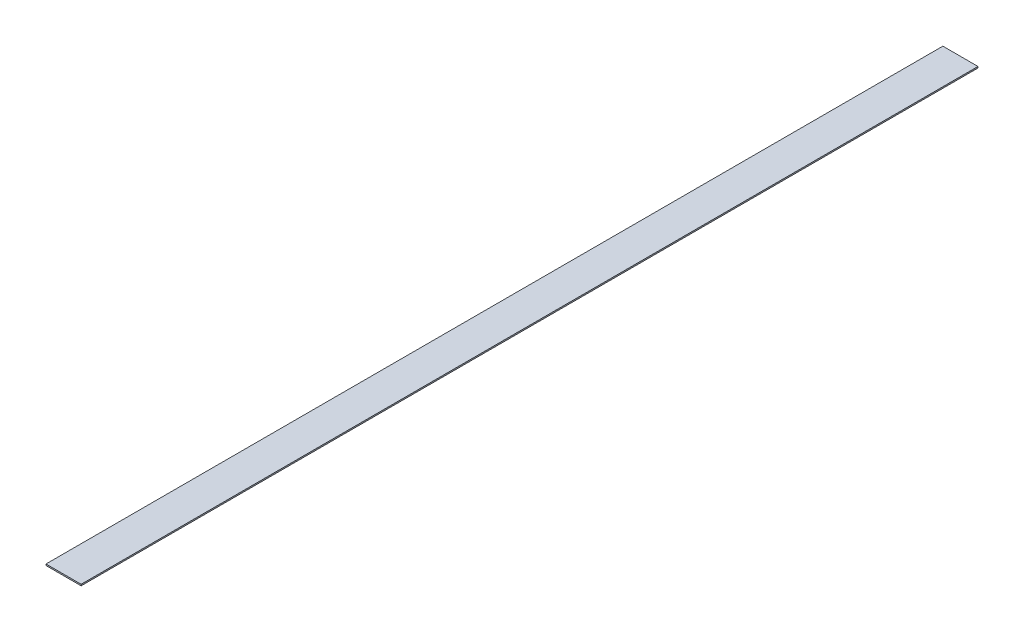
ISO-10303-21;
HEADER;
FILE_DESCRIPTION(('STEP AP214'),'2;1');
FILE_NAME('part.step','',(''),(''),'','','');
FILE_SCHEMA(('AUTOMOTIVE_DESIGN { 1 0 10303 214 1 1 1 1 }'));
ENDSEC;
DATA;
#1=APPLICATION_CONTEXT('core data for automotive mechanical design processes');
#2=APPLICATION_PROTOCOL_DEFINITION('international standard','automotive_design',2000,#1);
#3=PRODUCT_CONTEXT('',#1,'mechanical');
#4=PRODUCT('Part','Part','',(#3));
#5=PRODUCT_RELATED_PRODUCT_CATEGORY('part','',(#4));
#6=PRODUCT_DEFINITION_FORMATION('','',#4);
#7=PRODUCT_DEFINITION_CONTEXT('part definition',#1,'design');
#8=PRODUCT_DEFINITION('design','',#6,#7);
#9=PRODUCT_DEFINITION_SHAPE('','',#8);
#10=(LENGTH_UNIT() NAMED_UNIT(*) SI_UNIT(.MILLI.,.METRE.));
#11=(NAMED_UNIT(*) PLANE_ANGLE_UNIT() SI_UNIT($,.RADIAN.));
#12=(NAMED_UNIT(*) SI_UNIT($,.STERADIAN.) SOLID_ANGLE_UNIT());
#13=UNCERTAINTY_MEASURE_WITH_UNIT(LENGTH_MEASURE(1.E-05),#10,'distance_accuracy_value','');
#14=(GEOMETRIC_REPRESENTATION_CONTEXT(3) GLOBAL_UNCERTAINTY_ASSIGNED_CONTEXT((#13)) GLOBAL_UNIT_ASSIGNED_CONTEXT((#10,
#11,#12)) REPRESENTATION_CONTEXT('',''));
#15=CARTESIAN_POINT('',(0.,0.,0.));
#16=DIRECTION('',(0.,0.,1.));
#17=DIRECTION('',(1.,0.,0.));
#18=AXIS2_PLACEMENT_3D('',#15,#16,#17);
#19=CARTESIAN_POINT('',(0.,1.5,0.));
#20=DIRECTION('',(1.,0.,0.));
#21=DIRECTION('',(0.,0.,-1.));
#22=AXIS2_PLACEMENT_3D('',#19,#20,#21);
#23=PLANE('',#22);
#24=DIRECTION('',(0.,0.,1.));
#25=VECTOR('',#24,1.);
#26=CARTESIAN_POINT('',(0.,0.,0.));
#27=LINE('',#26,#25);
#28=CARTESIAN_POINT('',(0.,0.,-970.));
#29=VERTEX_POINT('',#28);
#30=CARTESIAN_POINT('',(0.,0.,0.));
#31=VERTEX_POINT('',#30);
#32=EDGE_CURVE('E108',#29,#31,#27,.T.);
#33=ORIENTED_EDGE('',*,*,#32,.T.);
#34=DIRECTION('',(0.,-1.,0.));
#35=VECTOR('',#34,1.);
#36=CARTESIAN_POINT('',(0.,1.5,0.));
#37=LINE('',#36,#35);
#38=CARTESIAN_POINT('',(0.,1.5,0.));
#39=VERTEX_POINT('',#38);
#40=EDGE_CURVE('E11',#39,#31,#37,.T.);
#41=ORIENTED_EDGE('',*,*,#40,.F.);
#42=DIRECTION('',(0.,0.,1.));
#43=VECTOR('',#42,1.);
#44=CARTESIAN_POINT('',(0.,1.5,0.));
#45=LINE('',#44,#43);
#46=CARTESIAN_POINT('',(0.,1.5,-970.));
#47=VERTEX_POINT('',#46);
#48=EDGE_CURVE('E94',#47,#39,#45,.T.);
#49=ORIENTED_EDGE('',*,*,#48,.F.);
#50=DIRECTION('',(0.,-1.,0.));
#51=VECTOR('',#50,1.);
#52=CARTESIAN_POINT('',(0.,1.5,-970.));
#53=LINE('',#52,#51);
#54=EDGE_CURVE('E104',#47,#29,#53,.T.);
#55=ORIENTED_EDGE('',*,*,#54,.T.);
#56=EDGE_LOOP('',(#33,#41,#49,#55));
#57=FACE_BOUND('',#56,.T.);
#58=ADVANCED_FACE('F43',(#57),#23,.F.);
#59=CARTESIAN_POINT('',(0.,1.5,0.));
#60=DIRECTION('',(0.,0.,-1.));
#61=DIRECTION('',(-1.,0.,0.));
#62=AXIS2_PLACEMENT_3D('',#59,#60,#61);
#63=PLANE('',#62);
#64=DIRECTION('',(1.,0.,0.));
#65=VECTOR('',#64,1.);
#66=CARTESIAN_POINT('',(0.,0.,0.));
#67=LINE('',#66,#65);
#68=CARTESIAN_POINT('',(38.,0.,0.));
#69=VERTEX_POINT('',#68);
#70=EDGE_CURVE('E98',#31,#69,#67,.T.);
#71=ORIENTED_EDGE('',*,*,#70,.T.);
#72=DIRECTION('',(0.,-1.,0.));
#73=VECTOR('',#72,1.);
#74=CARTESIAN_POINT('',(38.,1.5,0.));
#75=LINE('',#74,#73);
#76=CARTESIAN_POINT('',(38.,1.5,0.));
#77=VERTEX_POINT('',#76);
#78=EDGE_CURVE('E51',#77,#69,#75,.T.);
#79=ORIENTED_EDGE('',*,*,#78,.F.);
#80=DIRECTION('',(1.,0.,0.));
#81=VECTOR('',#80,1.);
#82=CARTESIAN_POINT('',(0.,1.5,0.));
#83=LINE('',#82,#81);
#84=EDGE_CURVE('E89',#39,#77,#83,.T.);
#85=ORIENTED_EDGE('',*,*,#84,.F.);
#86=ORIENTED_EDGE('',*,*,#40,.T.);
#87=EDGE_LOOP('',(#71,#79,#85,#86));
#88=FACE_BOUND('',#87,.T.);
#89=ADVANCED_FACE('F97',(#88),#63,.F.);
#90=CARTESIAN_POINT('',(38.,1.5,0.));
#91=DIRECTION('',(-1.,0.,0.));
#92=DIRECTION('',(0.,0.,1.));
#93=AXIS2_PLACEMENT_3D('',#90,#91,#92);
#94=PLANE('',#93);
#95=DIRECTION('',(0.,0.,-1.));
#96=VECTOR('',#95,1.);
#97=CARTESIAN_POINT('',(38.,0.,0.));
#98=LINE('',#97,#96);
#99=CARTESIAN_POINT('',(38.,0.,-970.));
#100=VERTEX_POINT('',#99);
#101=EDGE_CURVE('E76',#69,#100,#98,.T.);
#102=ORIENTED_EDGE('',*,*,#101,.T.);
#103=DIRECTION('',(0.,-1.,0.));
#104=VECTOR('',#103,1.);
#105=CARTESIAN_POINT('',(38.,1.5,-970.));
#106=LINE('',#105,#104);
#107=CARTESIAN_POINT('',(38.,1.5,-970.));
#108=VERTEX_POINT('',#107);
#109=EDGE_CURVE('E99',#108,#100,#106,.T.);
#110=ORIENTED_EDGE('',*,*,#109,.F.);
#111=DIRECTION('',(0.,0.,-1.));
#112=VECTOR('',#111,1.);
#113=CARTESIAN_POINT('',(38.,1.5,0.));
#114=LINE('',#113,#112);
#115=EDGE_CURVE('E92',#77,#108,#114,.T.);
#116=ORIENTED_EDGE('',*,*,#115,.F.);
#117=ORIENTED_EDGE('',*,*,#78,.T.);
#118=EDGE_LOOP('',(#102,#110,#116,#117));
#119=FACE_BOUND('',#118,.T.);
#120=ADVANCED_FACE('F100',(#119),#94,.F.);
#121=CARTESIAN_POINT('',(0.,1.5,-970.));
#122=DIRECTION('',(0.,0.,1.));
#123=DIRECTION('',(1.,0.,0.));
#124=AXIS2_PLACEMENT_3D('',#121,#122,#123);
#125=PLANE('',#124);
#126=DIRECTION('',(-1.,0.,0.));
#127=VECTOR('',#126,1.);
#128=CARTESIAN_POINT('',(0.,0.,-970.));
#129=LINE('',#128,#127);
#130=EDGE_CURVE('E82',#100,#29,#129,.T.);
#131=ORIENTED_EDGE('',*,*,#130,.T.);
#132=ORIENTED_EDGE('',*,*,#54,.F.);
#133=DIRECTION('',(-1.,0.,0.));
#134=VECTOR('',#133,1.);
#135=CARTESIAN_POINT('',(0.,1.5,-970.));
#136=LINE('',#135,#134);
#137=EDGE_CURVE('E59',#108,#47,#136,.T.);
#138=ORIENTED_EDGE('',*,*,#137,.F.);
#139=ORIENTED_EDGE('',*,*,#109,.T.);
#140=EDGE_LOOP('',(#131,#132,#138,#139));
#141=FACE_BOUND('',#140,.T.);
#142=ADVANCED_FACE('F115',(#141),#125,.F.);
#143=CARTESIAN_POINT('',(0.,1.5,0.));
#144=DIRECTION('',(0.,-1.,0.));
#145=DIRECTION('',(0.,0.,-1.));
#146=AXIS2_PLACEMENT_3D('',#143,#144,#145);
#147=PLANE('',#146);
#148=ORIENTED_EDGE('',*,*,#48,.T.);
#149=ORIENTED_EDGE('',*,*,#84,.T.);
#150=ORIENTED_EDGE('',*,*,#115,.T.);
#151=ORIENTED_EDGE('',*,*,#137,.T.);
#152=EDGE_LOOP('',(#148,#149,#150,#151));
#153=FACE_BOUND('',#152,.T.);
#154=ADVANCED_FACE('F90',(#153),#147,.F.);
#155=CARTESIAN_POINT('',(0.,0.,0.));
#156=DIRECTION('',(0.,-1.,0.));
#157=DIRECTION('',(0.,0.,-1.));
#158=AXIS2_PLACEMENT_3D('',#155,#156,#157);
#159=PLANE('',#158);
#160=ORIENTED_EDGE('',*,*,#32,.F.);
#161=ORIENTED_EDGE('',*,*,#130,.F.);
#162=ORIENTED_EDGE('',*,*,#101,.F.);
#163=ORIENTED_EDGE('',*,*,#70,.F.);
#164=EDGE_LOOP('',(#160,#161,#162,#163));
#165=FACE_BOUND('',#164,.T.);
#166=ADVANCED_FACE('F118',(#165),#159,.T.);
#167=CLOSED_SHELL('',(#58,#89,#120,#142,#154,#166));
#168=MANIFOLD_SOLID_BREP('B2',#167);
#169=ADVANCED_BREP_SHAPE_REPRESENTATION('',(#18,#168),#14);
#170=SHAPE_DEFINITION_REPRESENTATION(#9,#169);
ENDSEC;
END-ISO-10303-21;
